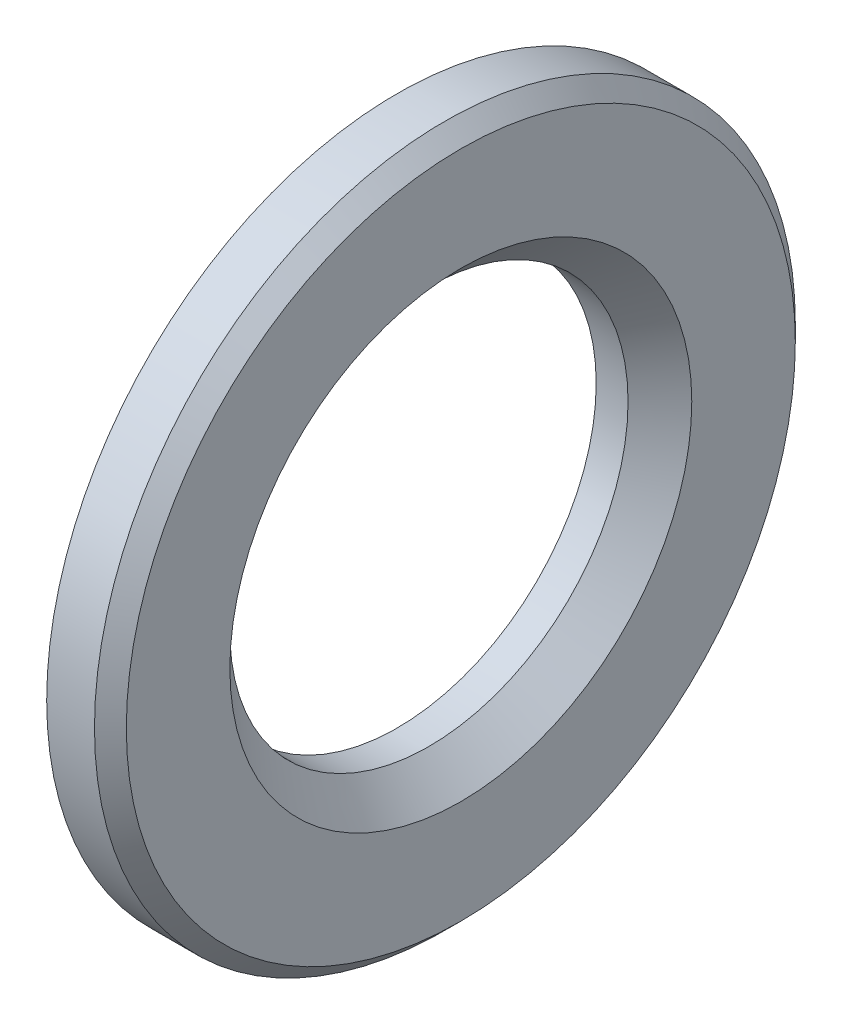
ISO-10303-21;
HEADER;
FILE_DESCRIPTION(('STEP AP214'),'2;1');
FILE_NAME('part.step','',(''),(''),'','','');
FILE_SCHEMA(('AUTOMOTIVE_DESIGN { 1 0 10303 214 1 1 1 1 }'));
ENDSEC;
DATA;
#1=APPLICATION_CONTEXT('core data for automotive mechanical design processes');
#2=APPLICATION_PROTOCOL_DEFINITION('international standard','automotive_design',2000,#1);
#3=PRODUCT_CONTEXT('',#1,'mechanical');
#4=PRODUCT('Part','Part','',(#3));
#5=PRODUCT_RELATED_PRODUCT_CATEGORY('part','',(#4));
#6=PRODUCT_DEFINITION_FORMATION('','',#4);
#7=PRODUCT_DEFINITION_CONTEXT('part definition',#1,'design');
#8=PRODUCT_DEFINITION('design','',#6,#7);
#9=PRODUCT_DEFINITION_SHAPE('','',#8);
#10=(LENGTH_UNIT() NAMED_UNIT(*) SI_UNIT(.MILLI.,.METRE.));
#11=(NAMED_UNIT(*) PLANE_ANGLE_UNIT() SI_UNIT($,.RADIAN.));
#12=(NAMED_UNIT(*) SI_UNIT($,.STERADIAN.) SOLID_ANGLE_UNIT());
#13=UNCERTAINTY_MEASURE_WITH_UNIT(LENGTH_MEASURE(1.E-05),#10,'distance_accuracy_value','');
#14=(GEOMETRIC_REPRESENTATION_CONTEXT(3) GLOBAL_UNCERTAINTY_ASSIGNED_CONTEXT((#13)) GLOBAL_UNIT_ASSIGNED_CONTEXT((#10,
#11,#12)) REPRESENTATION_CONTEXT('',''));
#15=CARTESIAN_POINT('',(0.,0.,0.));
#16=DIRECTION('',(0.,0.,1.));
#17=DIRECTION('',(1.,0.,0.));
#18=AXIS2_PLACEMENT_3D('',#15,#16,#17);
#19=CARTESIAN_POINT('',(4.,0.,0.));
#20=DIRECTION('',(1.,0.,0.));
#21=DIRECTION('',(0.,0.,-1.));
#22=AXIS2_PLACEMENT_3D('',#19,#20,#21);
#23=PLANE('',#22);
#24=CARTESIAN_POINT('',(4.,0.,0.));
#25=DIRECTION('',(1.,0.,0.));
#26=DIRECTION('',(0.,0.,-1.));
#27=AXIS2_PLACEMENT_3D('',#24,#25,#26);
#28=CIRCLE('',#27,21.);
#29=CARTESIAN_POINT('',(4.,0.,-21.));
#30=VERTEX_POINT('',#29);
#31=EDGE_CURVE('E44',#30,#30,#28,.T.);
#32=ORIENTED_EDGE('',*,*,#31,.T.);
#33=EDGE_LOOP('',(#32));
#34=FACE_BOUND('',#33,.T.);
#35=CARTESIAN_POINT('',(4.,0.,0.));
#36=DIRECTION('',(1.,0.,0.));
#37=DIRECTION('',(0.,0.,-1.));
#38=AXIS2_PLACEMENT_3D('',#35,#36,#37);
#39=CIRCLE('',#38,14.5);
#40=CARTESIAN_POINT('',(4.,0.,-14.5));
#41=VERTEX_POINT('',#40);
#42=EDGE_CURVE('E48',#41,#41,#39,.F.);
#43=ORIENTED_EDGE('',*,*,#42,.T.);
#44=EDGE_LOOP('',(#43));
#45=FACE_BOUND('',#44,.T.);
#46=ADVANCED_FACE('F37',(#34,#45),#23,.T.);
#47=CARTESIAN_POINT('',(0.,0.,0.));
#48=DIRECTION('',(1.,0.,0.));
#49=DIRECTION('',(0.,0.,-1.));
#50=AXIS2_PLACEMENT_3D('',#47,#48,#49);
#51=PLANE('',#50);
#52=CARTESIAN_POINT('',(0.,0.,0.));
#53=DIRECTION('',(1.,0.,0.));
#54=DIRECTION('',(0.,0.,-1.));
#55=AXIS2_PLACEMENT_3D('',#52,#53,#54);
#56=CIRCLE('',#55,22.);
#57=CARTESIAN_POINT('',(0.,0.,-22.));
#58=VERTEX_POINT('',#57);
#59=EDGE_CURVE('E57',#58,#58,#56,.T.);
#60=ORIENTED_EDGE('',*,*,#59,.F.);
#61=EDGE_LOOP('',(#60));
#62=FACE_BOUND('',#61,.T.);
#63=CARTESIAN_POINT('',(0.,0.,0.));
#64=DIRECTION('',(1.,0.,0.));
#65=DIRECTION('',(0.,0.,-1.));
#66=AXIS2_PLACEMENT_3D('',#63,#64,#65);
#67=CIRCLE('',#66,12.5);
#68=CARTESIAN_POINT('',(0.,0.,-12.5));
#69=VERTEX_POINT('',#68);
#70=EDGE_CURVE('E60',#69,#69,#67,.T.);
#71=ORIENTED_EDGE('',*,*,#70,.T.);
#72=EDGE_LOOP('',(#71));
#73=FACE_BOUND('',#72,.T.);
#74=ADVANCED_FACE('F64',(#62,#73),#51,.F.);
#75=CARTESIAN_POINT('',(4.,0.,0.));
#76=DIRECTION('',(-1.,0.,0.));
#77=DIRECTION('',(0.,0.,1.));
#78=AXIS2_PLACEMENT_3D('',#75,#76,#77);
#79=CYLINDRICAL_SURFACE('',#78,22.);
#80=CARTESIAN_POINT('',(3.,0.,0.));
#81=DIRECTION('',(1.,0.,0.));
#82=DIRECTION('',(0.,0.,-1.));
#83=AXIS2_PLACEMENT_3D('',#80,#81,#82);
#84=CIRCLE('',#83,22.);
#85=CARTESIAN_POINT('',(3.,0.,-22.));
#86=VERTEX_POINT('',#85);
#87=EDGE_CURVE('E10',#86,#86,#84,.F.);
#88=ORIENTED_EDGE('',*,*,#87,.T.);
#89=EDGE_LOOP('',(#88));
#90=FACE_BOUND('',#89,.T.);
#91=ORIENTED_EDGE('',*,*,#59,.T.);
#92=EDGE_LOOP('',(#91));
#93=FACE_BOUND('',#92,.T.);
#94=ADVANCED_FACE('F69',(#90,#93),#79,.T.);
#95=CARTESIAN_POINT('',(4.,0.,0.));
#96=DIRECTION('',(-1.,0.,0.));
#97=DIRECTION('',(0.,0.,1.));
#98=AXIS2_PLACEMENT_3D('',#95,#96,#97);
#99=CYLINDRICAL_SURFACE('',#98,12.5);
#100=CARTESIAN_POINT('',(2.,0.,0.));
#101=DIRECTION('',(1.,0.,0.));
#102=DIRECTION('',(0.,0.,-1.));
#103=AXIS2_PLACEMENT_3D('',#100,#101,#102);
#104=CIRCLE('',#103,12.5);
#105=CARTESIAN_POINT('',(2.,0.,-12.5));
#106=VERTEX_POINT('',#105);
#107=EDGE_CURVE('E52',#106,#106,#104,.T.);
#108=ORIENTED_EDGE('',*,*,#107,.T.);
#109=EDGE_LOOP('',(#108));
#110=FACE_BOUND('',#109,.T.);
#111=ORIENTED_EDGE('',*,*,#70,.F.);
#112=EDGE_LOOP('',(#111));
#113=FACE_BOUND('',#112,.T.);
#114=ADVANCED_FACE('F66',(#110,#113),#99,.F.);
#115=CARTESIAN_POINT('',(2.,0.,0.));
#116=DIRECTION('',(1.,0.,0.));
#117=DIRECTION('',(0.,0.,-1.));
#118=AXIS2_PLACEMENT_3D('',#115,#116,#117);
#119=CONICAL_SURFACE('',#118,12.5,0.78539816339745);
#120=ORIENTED_EDGE('',*,*,#42,.F.);
#121=EDGE_LOOP('',(#120));
#122=FACE_BOUND('',#121,.T.);
#123=ORIENTED_EDGE('',*,*,#107,.F.);
#124=EDGE_LOOP('',(#123));
#125=FACE_BOUND('',#124,.T.);
#126=ADVANCED_FACE('F68',(#122,#125),#119,.F.);
#127=CARTESIAN_POINT('',(4.,0.,0.));
#128=DIRECTION('',(-1.,0.,0.));
#129=DIRECTION('',(0.,0.,1.));
#130=AXIS2_PLACEMENT_3D('',#127,#128,#129);
#131=CONICAL_SURFACE('',#130,21.,0.785398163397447);
#132=ORIENTED_EDGE('',*,*,#87,.F.);
#133=EDGE_LOOP('',(#132));
#134=FACE_BOUND('',#133,.T.);
#135=ORIENTED_EDGE('',*,*,#31,.F.);
#136=EDGE_LOOP('',(#135));
#137=FACE_BOUND('',#136,.T.);
#138=ADVANCED_FACE('F39',(#134,#137),#131,.T.);
#139=CLOSED_SHELL('',(#46,#74,#94,#114,#126,#138));
#140=MANIFOLD_SOLID_BREP('B2',#139);
#141=ADVANCED_BREP_SHAPE_REPRESENTATION('',(#18,#140),#14);
#142=SHAPE_DEFINITION_REPRESENTATION(#9,#141);
ENDSEC;
END-ISO-10303-21;
